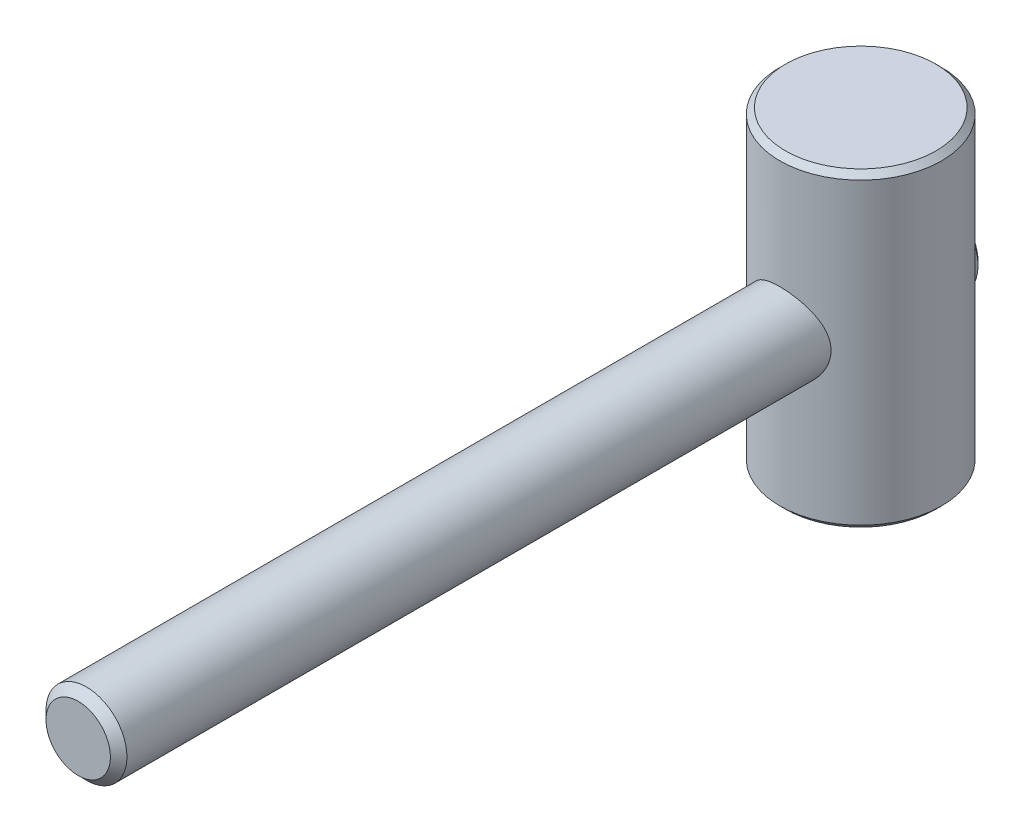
ISO-10303-21;
HEADER;
FILE_DESCRIPTION(('STEP AP214'),'2;1');
FILE_NAME('part.step','',(''),(''),'','','');
FILE_SCHEMA(('AUTOMOTIVE_DESIGN { 1 0 10303 214 1 1 1 1 }'));
ENDSEC;
DATA;
#1=APPLICATION_CONTEXT('core data for automotive mechanical design processes');
#2=APPLICATION_PROTOCOL_DEFINITION('international standard','automotive_design',2000,#1);
#3=PRODUCT_CONTEXT('',#1,'mechanical');
#4=PRODUCT('Part','Part','',(#3));
#5=PRODUCT_RELATED_PRODUCT_CATEGORY('part','',(#4));
#6=PRODUCT_DEFINITION_FORMATION('','',#4);
#7=PRODUCT_DEFINITION_CONTEXT('part definition',#1,'design');
#8=PRODUCT_DEFINITION('design','',#6,#7);
#9=PRODUCT_DEFINITION_SHAPE('','',#8);
#10=(LENGTH_UNIT() NAMED_UNIT(*) SI_UNIT(.MILLI.,.METRE.));
#11=(NAMED_UNIT(*) PLANE_ANGLE_UNIT() SI_UNIT($,.RADIAN.));
#12=(NAMED_UNIT(*) SI_UNIT($,.STERADIAN.) SOLID_ANGLE_UNIT());
#13=UNCERTAINTY_MEASURE_WITH_UNIT(LENGTH_MEASURE(1.E-05),#10,'distance_accuracy_value','');
#14=(GEOMETRIC_REPRESENTATION_CONTEXT(3) GLOBAL_UNCERTAINTY_ASSIGNED_CONTEXT((#13)) GLOBAL_UNIT_ASSIGNED_CONTEXT((#10,
#11,#12)) REPRESENTATION_CONTEXT('',''));
#15=CARTESIAN_POINT('',(0.,0.,0.));
#16=DIRECTION('',(0.,0.,1.));
#17=DIRECTION('',(1.,0.,0.));
#18=AXIS2_PLACEMENT_3D('',#15,#16,#17);
#19=CARTESIAN_POINT('',(0.,0.,-5.));
#20=DIRECTION('',(0.,0.,1.));
#21=DIRECTION('',(1.,0.,0.));
#22=AXIS2_PLACEMENT_3D('',#19,#20,#21);
#23=CYLINDRICAL_SURFACE('',#22,1.5);
#24=CARTESIAN_POINT('',(-0.947331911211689,1.16299709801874,-11.8465));
#25=CARTESIAN_POINT('',(-1.01351143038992,1.10908406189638,-11.8245053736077));
#26=CARTESIAN_POINT('',(-1.07489527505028,1.04969000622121,-11.801479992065));
#27=CARTESIAN_POINT('',(-1.18710041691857,0.920938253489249,-11.7558012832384));
#28=CARTESIAN_POINT('',(-1.2378650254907,0.851530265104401,-11.7331505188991));
#29=CARTESIAN_POINT('',(-1.32722551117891,0.704204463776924,-11.6908987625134));
#30=CARTESIAN_POINT('',(-1.36579908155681,0.626271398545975,-11.6713033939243));
#31=CARTESIAN_POINT('',(-1.42909401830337,0.46394540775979,-11.6379877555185));
#32=CARTESIAN_POINT('',(-1.45385048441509,0.379569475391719,-11.6242526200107));
#33=CARTESIAN_POINT('',(-1.48697739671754,0.213368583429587,-11.6056166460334));
#34=CARTESIAN_POINT('',(-1.49644089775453,0.131829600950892,-11.6001287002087));
#35=CARTESIAN_POINT('',(-1.5018928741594,-0.0318566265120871,-11.5969853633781));
#36=CARTESIAN_POINT('',(-1.49788424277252,-0.114003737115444,-11.5993282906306));
#37=CARTESIAN_POINT('',(-1.47773438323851,-0.267779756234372,-11.6108251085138));
#38=CARTESIAN_POINT('',(-1.4628558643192,-0.339634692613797,-11.6192692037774));
#39=CARTESIAN_POINT('',(-1.42308110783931,-0.479735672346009,-11.6410889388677));
#40=CARTESIAN_POINT('',(-1.39818007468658,-0.547979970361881,-11.6544669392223));
#41=CARTESIAN_POINT('',(-1.33746138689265,-0.683395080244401,-11.6855957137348));
#42=CARTESIAN_POINT('',(-1.30108662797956,-0.750265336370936,-11.7035578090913));
#43=CARTESIAN_POINT('',(-1.21901847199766,-0.877331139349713,-11.7415381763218));
#44=CARTESIAN_POINT('',(-1.17332890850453,-0.93752941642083,-11.7615556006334));
#45=CARTESIAN_POINT('',(-1.09644538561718,-1.02443697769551,-11.7926076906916));
#46=CARTESIAN_POINT('',(-1.06820925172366,-1.05384666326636,-11.8035531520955));
#47=CARTESIAN_POINT('',(-1.00945808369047,-1.11024632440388,-11.825238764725));
#48=CARTESIAN_POINT('',(-0.978947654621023,-1.13724095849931,-11.8359792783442));
#49=CARTESIAN_POINT('',(-0.947331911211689,-1.16299709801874,-11.8465));
#50=B_SPLINE_CURVE_WITH_KNOTS('',3,(#24,#25,#26,#27,#28,#29,#30,#31,#32,#33,#34,#35,#36,#37,#38,
#39,#40,#41,#42,#43,#44,#45,#46,#47,#48,#49),.UNSPECIFIED.,.F.,.F.,(4,2,2,2,2,2,2,2,2,2,2,2,4),
(0.,0.264174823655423,0.52972579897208,0.795759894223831,1.06111506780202,1.30649824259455,
1.55182872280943,1.77244859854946,1.99317416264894,2.22691434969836,2.46055853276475,
2.58708455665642,2.71336100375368),.UNSPECIFIED.);
#51=CARTESIAN_POINT('',(-0.947331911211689,1.16299709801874,-11.8465));
#52=VERTEX_POINT('',#51);
#53=CARTESIAN_POINT('',(-0.947331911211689,-1.16299709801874,-11.8465));
#54=VERTEX_POINT('',#53);
#55=EDGE_CURVE('E271',#52,#54,#50,.T.);
#56=ORIENTED_EDGE('',*,*,#55,.F.);
#57=CARTESIAN_POINT('',(0.,0.,-11.8465));
#58=DIRECTION('',(0.,0.,1.));
#59=DIRECTION('',(1.,0.,0.));
#60=AXIS2_PLACEMENT_3D('',#57,#58,#59);
#61=CIRCLE('',#60,1.5);
#62=EDGE_CURVE('E308',#52,#54,#61,.T.);
#63=ORIENTED_EDGE('',*,*,#62,.T.);
#64=EDGE_LOOP('',(#56,#63));
#65=FACE_BOUND('',#64,.T.);
#66=ADVANCED_FACE('F14',(#65),#23,.T.);
#67=CARTESIAN_POINT('',(0.,0.,-12.));
#68=DIRECTION('',(0.,0.,1.));
#69=DIRECTION('',(1.,0.,0.));
#70=AXIS2_PLACEMENT_3D('',#67,#68,#69);
#71=PLANE('',#70);
#72=DIRECTION('',(0.,-1.,0.));
#73=VECTOR('',#72,1.);
#74=CARTESIAN_POINT('',(0.3,0.,-12.));
#75=LINE('',#74,#73);
#76=CARTESIAN_POINT('',(0.3,1.31265465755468,-12.));
#77=VERTEX_POINT('',#76);
#78=CARTESIAN_POINT('',(0.3,-1.31265465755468,-12.));
#79=VERTEX_POINT('',#78);
#80=EDGE_CURVE('E36',#77,#79,#75,.T.);
#81=ORIENTED_EDGE('',*,*,#80,.F.);
#82=CARTESIAN_POINT('',(0.,0.,-12.));
#83=DIRECTION('',(0.,0.,1.));
#84=DIRECTION('',(1.,0.,0.));
#85=AXIS2_PLACEMENT_3D('',#82,#83,#84);
#86=CIRCLE('',#85,1.3465);
#87=EDGE_CURVE('E305',#79,#77,#86,.T.);
#88=ORIENTED_EDGE('',*,*,#87,.F.);
#89=EDGE_LOOP('',(#81,#88));
#90=FACE_BOUND('',#89,.T.);
#91=ADVANCED_FACE('F231',(#90),#71,.F.);
#92=CARTESIAN_POINT('',(0.,0.,-12.));
#93=DIRECTION('',(0.,0.,1.));
#94=DIRECTION('',(1.,0.,0.));
#95=AXIS2_PLACEMENT_3D('',#92,#93,#94);
#96=CONICAL_SURFACE('',#95,1.3465,0.785398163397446);
#97=CARTESIAN_POINT('',(0.992835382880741,1.14506318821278,-11.83095));
#98=CARTESIAN_POINT('',(0.929590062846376,1.17057691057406,-11.8531359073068));
#99=CARTESIAN_POINT('',(0.864893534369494,1.19430901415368,-11.8734384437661));
#100=CARTESIAN_POINT('',(0.733580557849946,1.23716783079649,-11.9097164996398));
#101=CARTESIAN_POINT('',(0.666989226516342,1.25633751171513,-11.9257325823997));
#102=CARTESIAN_POINT('',(0.531496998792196,1.28959120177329,-11.9533515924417));
#103=CARTESIAN_POINT('',(0.462592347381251,1.30366645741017,-11.9649469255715));
#104=CARTESIAN_POINT('',(0.322550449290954,1.32622709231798,-11.9834605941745));
#105=CARTESIAN_POINT('',(0.251397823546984,1.33465555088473,-11.9903313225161));
#106=CARTESIAN_POINT('',(0.1798,1.33988292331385,-11.994607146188));
#107=B_SPLINE_CURVE_WITH_KNOTS('',3,(#97,#98,#99,#100,#101,#102,#103,#104,#105,#106),
.UNSPECIFIED.,.F.,.F.,(4,2,2,2,4),(0.,0.215180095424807,0.428245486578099,0.641675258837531,
0.857225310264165),.UNSPECIFIED.);
#108=CARTESIAN_POINT('',(0.947331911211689,1.16299709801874,-11.8465));
#109=VERTEX_POINT('',#108);
#110=CARTESIAN_POINT('',(0.674247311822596,1.25340780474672,-11.92325));
#111=VERTEX_POINT('',#110);
#112=EDGE_CURVE('E108',#109,#111,#107,.T.);
#113=ORIENTED_EDGE('',*,*,#112,.F.);
#114=CARTESIAN_POINT('',(0.947331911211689,-1.16299709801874,-11.8465));
#115=VERTEX_POINT('',#114);
#116=EDGE_CURVE('E309',#115,#109,#61,.T.);
#117=ORIENTED_EDGE('',*,*,#116,.F.);
#118=CARTESIAN_POINT('',(0.1798,-1.33988292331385,-11.994607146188));
#119=CARTESIAN_POINT('',(0.236038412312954,-1.335761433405,-11.9912402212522));
#120=CARTESIAN_POINT('',(0.292017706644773,-1.3296804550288,-11.9862800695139));
#121=CARTESIAN_POINT('',(0.40306300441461,-1.31386344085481,-11.9733225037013));
#122=CARTESIAN_POINT('',(0.458129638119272,-1.30413004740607,-11.9653272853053));
#123=CARTESIAN_POINT('',(0.566267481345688,-1.28142693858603,-11.9465768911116));
#124=CARTESIAN_POINT('',(0.619355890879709,-1.26850488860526,-11.9358623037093));
#125=CARTESIAN_POINT('',(0.724099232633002,-1.23969917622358,-11.9117977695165));
#126=CARTESIAN_POINT('',(0.775754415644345,-1.22381603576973,-11.8984482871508));
#127=CARTESIAN_POINT('',(0.854754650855,-1.1971455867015,-11.8758046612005));
#128=CARTESIAN_POINT('',(0.882653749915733,-1.18725045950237,-11.8673620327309));
#129=CARTESIAN_POINT('',(0.938066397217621,-1.16670181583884,-11.8497157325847));
#130=CARTESIAN_POINT('',(0.965577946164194,-1.15604541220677,-11.8405091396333));
#131=CARTESIAN_POINT('',(0.992835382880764,-1.14506318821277,-11.83095));
#132=B_SPLINE_CURVE_WITH_KNOTS('',3,(#118,#119,#120,#121,#122,#123,#124,#125,#126,#127,#128,
#129,#130,#131),.UNSPECIFIED.,.F.,.F.,(4,2,2,2,2,2,4),(0.,0.169384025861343,0.338645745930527,
0.505516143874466,0.672357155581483,0.764685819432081,0.857385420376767),.UNSPECIFIED.);
#133=CARTESIAN_POINT('',(0.674247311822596,-1.25340780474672,-11.92325));
#134=VERTEX_POINT('',#133);
#135=EDGE_CURVE('E114',#134,#115,#132,.T.);
#136=ORIENTED_EDGE('',*,*,#135,.F.);
#137=CARTESIAN_POINT('',(0.,0.,-11.92325));
#138=DIRECTION('',(0.,0.,-1.));
#139=DIRECTION('',(-1.,0.,0.));
#140=AXIS2_PLACEMENT_3D('',#137,#138,#139);
#141=CIRCLE('',#140,1.42325);
#142=CARTESIAN_POINT('',(0.3,-1.39127300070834,-11.92325));
#143=VERTEX_POINT('',#142);
#144=EDGE_CURVE('E194',#134,#143,#141,.T.);
#145=ORIENTED_EDGE('',*,*,#144,.T.);
#146=CARTESIAN_POINT('',(0.3,1.4704082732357,-11.8458));
#147=CARTESIAN_POINT('',(0.3,1.43432199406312,-11.881156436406));
#148=CARTESIAN_POINT('',(0.3,1.39821111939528,-11.9164877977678));
#149=CARTESIAN_POINT('',(0.3,1.32586601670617,-11.9871401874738));
#150=CARTESIAN_POINT('',(0.3,1.28963168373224,-12.0224611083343));
#151=CARTESIAN_POINT('',(0.3,1.21609681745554,-12.0939762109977));
#152=CARTESIAN_POINT('',(0.3,1.17879403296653,-12.1301680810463));
#153=CARTESIAN_POINT('',(0.3,1.10413383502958,-12.2023744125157));
#154=CARTESIAN_POINT('',(0.3,1.06677660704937,-12.2383890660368));
#155=CARTESIAN_POINT('',(0.3,0.959421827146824,-12.3414650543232));
#156=CARTESIAN_POINT('',(0.3,0.88924153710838,-12.4083374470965));
#157=CARTESIAN_POINT('',(0.3,0.782999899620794,-12.5080826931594));
#158=CARTESIAN_POINT('',(0.3,0.7473051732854,-12.5413456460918));
#159=CARTESIAN_POINT('',(0.3,0.67557200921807,-12.6074459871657));
#160=CARTESIAN_POINT('',(0.3,0.639533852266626,-12.6402836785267));
#161=CARTESIAN_POINT('',(0.3,0.567825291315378,-12.7044893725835));
#162=CARTESIAN_POINT('',(0.3,0.532169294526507,-12.7358734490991));
#163=CARTESIAN_POINT('',(0.3,0.459887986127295,-12.7977398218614));
#164=CARTESIAN_POINT('',(0.3,0.423260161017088,-12.8282192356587));
#165=CARTESIAN_POINT('',(0.3,0.367400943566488,-12.8723076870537));
#166=CARTESIAN_POINT('',(0.3,0.348748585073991,-12.8866467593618));
#167=CARTESIAN_POINT('',(0.3,0.310930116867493,-12.9146268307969));
#168=CARTESIAN_POINT('',(0.3,0.291764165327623,-12.9282680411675));
#169=CARTESIAN_POINT('',(0.3,0.252814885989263,-12.9544441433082));
#170=CARTESIAN_POINT('',(0.3,0.233034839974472,-12.9669838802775));
#171=CARTESIAN_POINT('',(0.3,0.192530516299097,-12.990417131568));
#172=CARTESIAN_POINT('',(0.3,0.171808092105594,-13.0013137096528));
#173=CARTESIAN_POINT('',(0.3,0.145940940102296,-13.0129096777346));
#174=CARTESIAN_POINT('',(0.3,0.141366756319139,-13.0148871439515));
#175=CARTESIAN_POINT('',(0.3,0.132159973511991,-13.0187064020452));
#176=CARTESIAN_POINT('',(0.3,0.127527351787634,-13.0205481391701));
#177=CARTESIAN_POINT('',(0.3,0.113544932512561,-13.0258474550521));
#178=CARTESIAN_POINT('',(0.3,0.104108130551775,-13.0290802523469));
#179=CARTESIAN_POINT('',(0.3,0.0851689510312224,-13.0347728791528));
#180=CARTESIAN_POINT('',(0.3,0.0756701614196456,-13.0372444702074));
#181=CARTESIAN_POINT('',(0.3,0.0564948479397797,-13.0413716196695));
#182=CARTESIAN_POINT('',(0.3,0.0468182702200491,-13.0430269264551));
#183=CARTESIAN_POINT('',(0.3,0.0172377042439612,-13.0466422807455));
#184=CARTESIAN_POINT('',(0.3,-0.00287379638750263,-13.047140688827));
#185=CARTESIAN_POINT('',(0.3,-0.0428030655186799,-13.0441231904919));
#186=CARTESIAN_POINT('',(0.3,-0.0626200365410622,-13.0405978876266));
#187=CARTESIAN_POINT('',(0.3,-0.108260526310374,-13.0285808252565));
#188=CARTESIAN_POINT('',(0.3,-0.133719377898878,-13.0187703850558));
#189=CARTESIAN_POINT('',(0.3,-0.17070809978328,-13.0015048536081));
#190=CARTESIAN_POINT('',(0.3,-0.182880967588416,-12.9952966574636));
#191=CARTESIAN_POINT('',(0.3,-0.206871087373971,-12.9822268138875));
#192=CARTESIAN_POINT('',(0.3,-0.218688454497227,-12.9753653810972));
#193=CARTESIAN_POINT('',(0.3,-0.256757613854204,-12.9521887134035));
#194=CARTESIAN_POINT('',(0.3,-0.282394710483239,-12.9348757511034));
#195=CARTESIAN_POINT('',(0.3,-0.332686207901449,-12.8988661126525));
#196=CARTESIAN_POINT('',(0.3,-0.357339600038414,-12.8801680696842));
#197=CARTESIAN_POINT('',(0.3,-0.406041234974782,-12.8418786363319));
#198=CARTESIAN_POINT('',(0.3,-0.43008777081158,-12.8222850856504));
#199=CARTESIAN_POINT('',(0.3,-0.477720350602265,-12.7825441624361));
#200=CARTESIAN_POINT('',(0.3,-0.501306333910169,-12.762396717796));
#201=CARTESIAN_POINT('',(0.3,-0.571740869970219,-12.7012598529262));
#202=CARTESIAN_POINT('',(0.3,-0.618101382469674,-12.6597098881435));
#203=CARTESIAN_POINT('',(0.3,-0.710039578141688,-12.5759094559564));
#204=CARTESIAN_POINT('',(0.3,-0.755618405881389,-12.5336602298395));
#205=CARTESIAN_POINT('',(0.3,-0.857897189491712,-12.4378825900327));
#206=CARTESIAN_POINT('',(0.3,-0.914473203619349,-12.3842219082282));
#207=CARTESIAN_POINT('',(0.3,-1.02726219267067,-12.2764551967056));
#208=CARTESIAN_POINT('',(0.3,-1.08347493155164,-12.2223489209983));
#209=CARTESIAN_POINT('',(0.3,-1.19491746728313,-12.1145797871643));
#210=CARTESIAN_POINT('',(0.3,-1.25015053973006,-12.0609203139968));
#211=CARTESIAN_POINT('',(0.3,-1.36040840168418,-11.9534572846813));
#212=CARTESIAN_POINT('',(0.3,-1.41543330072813,-11.8996538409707));
#213=CARTESIAN_POINT('',(0.3,-1.4704082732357,-11.8458));
#214=B_SPLINE_CURVE_WITH_KNOTS('',3,(#146,#147,#148,#149,#150,#151,#152,#153,#154,#155,#156,
#157,#158,#159,#160,#161,#162,#163,#164,#165,#166,#167,#168,#169,#170,#171,#172,#173,#174,#175,
#176,#177,#178,#179,#180,#181,#182,#183,#184,#185,#186,#187,#188,#189,#190,#191,#192,#193,#194,
#195,#196,#197,#198,#199,#200,#201,#202,#203,#204,#205,#206,#207,#208,#209,#210,#211,#212,#213),
.UNSPECIFIED.,.F.,.F.,(4,2,2,2,2,2,2,2,2,2,2,2,2,2,2,2,2,2,2,2,2,2,2,2,2,2,2,2,2,2,2,2,2,4),(0.,
0.151560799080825,0.303364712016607,0.459287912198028,0.614959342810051,0.905769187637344,
1.05213984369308,1.1983996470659,1.34089509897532,1.48380422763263,1.55437528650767,
1.62492485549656,1.69514667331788,1.76523589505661,1.78018397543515,1.79513805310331,
1.82503814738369,1.85444992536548,1.88387076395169,1.94377833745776,2.00382609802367,
2.08518752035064,2.12617578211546,2.16715062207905,2.25986253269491,2.35266718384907,
2.44570893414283,2.53876285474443,2.72550711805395,2.91194943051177,3.14587396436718,
3.37993768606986,3.6109572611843,3.84183089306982),.UNSPECIFIED.);
#215=EDGE_CURVE('E227',#79,#143,#214,.T.);
#216=ORIENTED_EDGE('',*,*,#215,.F.);
#217=ORIENTED_EDGE('',*,*,#87,.T.);
#218=CARTESIAN_POINT('',(0.3,1.39127300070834,-11.92325));
#219=VERTEX_POINT('',#218);
#220=EDGE_CURVE('E32',#219,#77,#214,.T.);
#221=ORIENTED_EDGE('',*,*,#220,.F.);
#222=CARTESIAN_POINT('',(0.,0.,-11.92325));
#223=DIRECTION('',(0.,0.,-1.));
#224=DIRECTION('',(-1.,0.,0.));
#225=AXIS2_PLACEMENT_3D('',#222,#223,#224);
#226=CIRCLE('',#225,1.42325);
#227=EDGE_CURVE('E104',#219,#111,#226,.T.);
#228=ORIENTED_EDGE('',*,*,#227,.T.);
#229=EDGE_LOOP('',(#113,#117,#136,#145,#216,#217,#221,#228));
#230=FACE_BOUND('',#229,.T.);
#231=ADVANCED_FACE('F106',(#230),#96,.T.);
#232=CARTESIAN_POINT('',(-0.3,0.,-42.3));
#233=DIRECTION('',(1.,0.,0.));
#234=DIRECTION('',(0.,-1.,0.));
#235=AXIS2_PLACEMENT_3D('',#232,#233,#234);
#236=CYLINDRICAL_SURFACE('',#235,31.5);
#237=CARTESIAN_POINT('',(-0.3,-1.33111241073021,-10.8281373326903));
#238=CARTESIAN_POINT('',(-0.262266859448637,-1.33962103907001,-10.8284977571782));
#239=CARTESIAN_POINT('',(-0.224170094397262,-1.34651682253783,-10.828792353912));
#240=CARTESIAN_POINT('',(-0.14752354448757,-1.35705208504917,-10.8292445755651));
#241=CARTESIAN_POINT('',(-0.108973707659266,-1.36069118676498,-10.8294021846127));
#242=CARTESIAN_POINT('',(-0.0324105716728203,-1.36464401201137,-10.8295734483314));
#243=CARTESIAN_POINT('',(0.00559964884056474,-1.3650173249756,-10.8295896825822));
#244=CARTESIAN_POINT('',(0.0815076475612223,-1.36259212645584,-10.8294844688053));
#245=CARTESIAN_POINT('',(0.119405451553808,-1.35979440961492,-10.8293630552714));
#246=CARTESIAN_POINT('',(0.205128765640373,-1.34986012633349,-10.8289356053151));
#247=CARTESIAN_POINT('',(0.252842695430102,-1.34174825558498,-10.8285882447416));
#248=CARTESIAN_POINT('',(0.3,-1.33111241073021,-10.8281373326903));
#249=B_SPLINE_CURVE_WITH_KNOTS('',3,(#237,#238,#239,#240,#241,#242,#243,#244,#245,#246,#247,
#248),.UNSPECIFIED.,.F.,.F.,(4,2,2,2,2,4),(0.,0.116010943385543,0.232035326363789,
0.345938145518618,0.459812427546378,0.604746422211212),.UNSPECIFIED.);
#250=CARTESIAN_POINT('',(-0.3,-1.33111241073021,-10.8281373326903));
#251=VERTEX_POINT('',#250);
#252=CARTESIAN_POINT('',(0.3,-1.33111241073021,-10.8281373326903));
#253=VERTEX_POINT('',#252);
#254=EDGE_CURVE('E199',#251,#253,#249,.T.);
#255=ORIENTED_EDGE('',*,*,#254,.F.);
#256=CARTESIAN_POINT('',(-0.3,0.,-42.3));
#257=DIRECTION('',(-1.,0.,0.));
#258=DIRECTION('',(0.,1.,0.));
#259=AXIS2_PLACEMENT_3D('',#256,#257,#258);
#260=CIRCLE('',#259,31.5);
#261=CARTESIAN_POINT('',(-0.3,1.33111241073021,-10.8281373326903));
#262=VERTEX_POINT('',#261);
#263=EDGE_CURVE('E19',#251,#262,#260,.T.);
#264=ORIENTED_EDGE('',*,*,#263,.T.);
#265=CARTESIAN_POINT('',(0.3,1.33111241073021,-10.8281373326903));
#266=CARTESIAN_POINT('',(0.262266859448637,1.33962103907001,-10.8284977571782));
#267=CARTESIAN_POINT('',(0.224170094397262,1.34651682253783,-10.828792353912));
#268=CARTESIAN_POINT('',(0.14752354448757,1.35705208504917,-10.8292445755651));
#269=CARTESIAN_POINT('',(0.108973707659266,1.36069118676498,-10.8294021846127));
#270=CARTESIAN_POINT('',(0.0324105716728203,1.36464401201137,-10.8295734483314));
#271=CARTESIAN_POINT('',(-0.00559964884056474,1.3650173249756,-10.8295896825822));
#272=CARTESIAN_POINT('',(-0.0815076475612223,1.36259212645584,-10.8294844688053));
#273=CARTESIAN_POINT('',(-0.119405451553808,1.35979440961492,-10.8293630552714));
#274=CARTESIAN_POINT('',(-0.205128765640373,1.34986012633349,-10.8289356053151));
#275=CARTESIAN_POINT('',(-0.252842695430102,1.34174825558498,-10.8285882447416));
#276=CARTESIAN_POINT('',(-0.3,1.33111241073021,-10.8281373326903));
#277=B_SPLINE_CURVE_WITH_KNOTS('',3,(#265,#266,#267,#268,#269,#270,#271,#272,#273,#274,#275,
#276),.UNSPECIFIED.,.F.,.F.,(4,2,2,2,2,4),(0.,0.116010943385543,0.232035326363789,
0.345938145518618,0.459812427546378,0.604746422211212),.UNSPECIFIED.);
#278=CARTESIAN_POINT('',(0.3,1.33111241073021,-10.8281373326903));
#279=VERTEX_POINT('',#278);
#280=EDGE_CURVE('E143',#279,#262,#277,.T.);
#281=ORIENTED_EDGE('',*,*,#280,.F.);
#282=CARTESIAN_POINT('',(0.3,0.,-42.3));
#283=DIRECTION('',(-1.,0.,0.));
#284=DIRECTION('',(0.,1.,0.));
#285=AXIS2_PLACEMENT_3D('',#282,#283,#284);
#286=CIRCLE('',#285,31.5);
#287=EDGE_CURVE('E130',#253,#279,#286,.T.);
#288=ORIENTED_EDGE('',*,*,#287,.F.);
#289=EDGE_LOOP('',(#255,#264,#281,#288));
#290=FACE_BOUND('',#289,.T.);
#291=ADVANCED_FACE('F206',(#290),#236,.F.);
#292=CARTESIAN_POINT('',(0.3,0.,-42.3));
#293=DIRECTION('',(-1.,0.,0.));
#294=DIRECTION('',(0.,1.,0.));
#295=AXIS2_PLACEMENT_3D('',#292,#293,#294);
#296=PLANE('',#295);
#297=CARTESIAN_POINT('',(0.3,-0.671318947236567,-11.2353020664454));
#298=CARTESIAN_POINT('',(0.3,-0.697833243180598,-11.2595157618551));
#299=CARTESIAN_POINT('',(0.3,-0.724235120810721,-11.283851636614));
#300=CARTESIAN_POINT('',(0.3,-0.776860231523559,-11.3327148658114));
#301=CARTESIAN_POINT('',(0.3,-0.803083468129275,-11.3572422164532));
#302=CARTESIAN_POINT('',(0.3,-0.881553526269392,-11.4310312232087));
#303=CARTESIAN_POINT('',(0.3,-0.933603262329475,-11.4805021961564));
#304=CARTESIAN_POINT('',(0.3,-1.03737516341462,-11.5797783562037));
#305=CARTESIAN_POINT('',(0.3,-1.08909735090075,-11.6295835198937));
#306=CARTESIAN_POINT('',(0.3,-1.19232568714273,-11.7294186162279));
#307=CARTESIAN_POINT('',(0.3,-1.24383183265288,-11.7794485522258));
#308=CARTESIAN_POINT('',(0.3,-1.41719880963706,-11.9483370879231));
#309=CARTESIAN_POINT('',(0.3,-1.53872304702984,-12.0675409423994));
#310=CARTESIAN_POINT('',(0.3,-1.72072148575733,-12.2466471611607));
#311=CARTESIAN_POINT('',(0.3,-1.78134186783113,-12.3064015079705));
#312=CARTESIAN_POINT('',(0.3,-1.9025053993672,-12.4259878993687));
#313=CARTESIAN_POINT('',(0.3,-1.96304854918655,-12.4858199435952));
#314=CARTESIAN_POINT('',(0.3,-2.02356348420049,-12.545680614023));
#315=B_SPLINE_CURVE_WITH_KNOTS('',3,(#297,#298,#299,#300,#301,#302,#303,#304,#305,#306,#307,
#308,#309,#310,#311,#312,#313,#314),.UNSPECIFIED.,.F.,.F.,(4,2,2,2,2,2,2,2,4),(0.,
0.107719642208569,0.215437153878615,0.430861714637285,0.646271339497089,0.861684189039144,
1.37236666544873,1.62772666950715,1.88308548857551),.UNSPECIFIED.);
#316=CARTESIAN_POINT('',(0.3,-1.33111241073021,-11.8645));
#317=VERTEX_POINT('',#316);
#318=EDGE_CURVE('E178',#317,#143,#315,.T.);
#319=ORIENTED_EDGE('',*,*,#318,.F.);
#320=DIRECTION('',(0.,0.,1.));
#321=VECTOR('',#320,1.);
#322=CARTESIAN_POINT('',(0.3,-1.33111241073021,-6.));
#323=LINE('',#322,#321);
#324=EDGE_CURVE('E292',#253,#317,#323,.F.);
#325=ORIENTED_EDGE('',*,*,#324,.F.);
#326=ORIENTED_EDGE('',*,*,#287,.T.);
#327=DIRECTION('',(0.,0.,1.));
#328=VECTOR('',#327,1.);
#329=CARTESIAN_POINT('',(0.3,1.33111241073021,-6.));
#330=LINE('',#329,#328);
#331=CARTESIAN_POINT('',(0.3,1.33111241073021,-11.8645));
#332=VERTEX_POINT('',#331);
#333=EDGE_CURVE('E299',#332,#279,#330,.T.);
#334=ORIENTED_EDGE('',*,*,#333,.F.);
#335=CARTESIAN_POINT('',(0.3,2.02134819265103,-12.5434892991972));
#336=CARTESIAN_POINT('',(0.3,1.96583089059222,-12.4885737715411));
#337=CARTESIAN_POINT('',(0.3,1.91028984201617,-12.4336823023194));
#338=CARTESIAN_POINT('',(0.3,1.79914422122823,-12.3239633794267));
#339=CARTESIAN_POINT('',(0.3,1.74353964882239,-12.2691359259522));
#340=CARTESIAN_POINT('',(0.3,1.57661382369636,-12.1047805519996));
#341=CARTESIAN_POINT('',(0.3,1.46517376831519,-11.9953729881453));
#342=CARTESIAN_POINT('',(0.3,1.29755058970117,-11.8317264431));
#343=CARTESIAN_POINT('',(0.3,1.24159669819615,-11.7772528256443));
#344=CARTESIAN_POINT('',(0.3,1.12946087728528,-11.668542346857));
#345=CARTESIAN_POINT('',(0.3,1.07327895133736,-11.614305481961));
#346=CARTESIAN_POINT('',(0.3,0.960561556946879,-11.5061914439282));
#347=CARTESIAN_POINT('',(0.3,0.904026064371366,-11.4523142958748));
#348=CARTESIAN_POINT('',(0.3,0.81878330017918,-11.3719612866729));
#349=CARTESIAN_POINT('',(0.3,0.790295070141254,-11.3452534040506));
#350=CARTESIAN_POINT('',(0.3,0.733115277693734,-11.2920550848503));
#351=CARTESIAN_POINT('',(0.3,0.704423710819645,-11.2655646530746));
#352=CARTESIAN_POINT('',(0.3,0.675602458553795,-11.2392149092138));
#353=B_SPLINE_CURVE_WITH_KNOTS('',3,(#335,#336,#337,#338,#339,#340,#341,#342,#343,#344,#345,
#346,#347,#348,#349,#350,#351,#352),.UNSPECIFIED.,.F.,.F.,(4,2,2,2,2,2,2,2,4),(0.,
0.234266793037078,0.468534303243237,0.937041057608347,1.1713137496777,1.40558290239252,
1.63986822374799,1.75701676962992,1.87416789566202),.UNSPECIFIED.);
#354=EDGE_CURVE('E170',#219,#332,#353,.T.);
#355=ORIENTED_EDGE('',*,*,#354,.F.);
#356=ORIENTED_EDGE('',*,*,#220,.T.);
#357=ORIENTED_EDGE('',*,*,#80,.T.);
#358=ORIENTED_EDGE('',*,*,#215,.T.);
#359=EDGE_LOOP('',(#319,#325,#326,#334,#355,#356,#357,#358));
#360=FACE_BOUND('',#359,.T.);
#361=ADVANCED_FACE('F210',(#360),#296,.T.);
#362=CARTESIAN_POINT('',(-0.3,1.31265465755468,-12.));
#363=VERTEX_POINT('',#362);
#364=CARTESIAN_POINT('',(-0.3,-1.31265465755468,-12.));
#365=VERTEX_POINT('',#364);
#366=EDGE_CURVE('E301',#363,#365,#86,.T.);
#367=ORIENTED_EDGE('',*,*,#366,.F.);
#368=DIRECTION('',(0.,-1.,0.));
#369=VECTOR('',#368,1.);
#370=CARTESIAN_POINT('',(-0.3,0.,-12.));
#371=LINE('',#370,#369);
#372=EDGE_CURVE('E311',#363,#365,#371,.T.);
#373=ORIENTED_EDGE('',*,*,#372,.T.);
#374=EDGE_LOOP('',(#367,#373));
#375=FACE_BOUND('',#374,.T.);
#376=ADVANCED_FACE('F218',(#375),#71,.F.);
#377=CARTESIAN_POINT('',(-0.1798,1.33988292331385,-11.994607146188));
#378=CARTESIAN_POINT('',(-0.236038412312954,1.335761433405,-11.9912402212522));
#379=CARTESIAN_POINT('',(-0.292017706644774,1.3296804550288,-11.9862800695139));
#380=CARTESIAN_POINT('',(-0.403063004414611,1.31386344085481,-11.9733225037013));
#381=CARTESIAN_POINT('',(-0.458129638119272,1.30413004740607,-11.9653272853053));
#382=CARTESIAN_POINT('',(-0.566267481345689,1.28142693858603,-11.9465768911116));
#383=CARTESIAN_POINT('',(-0.61935589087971,1.26850488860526,-11.9358623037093));
#384=CARTESIAN_POINT('',(-0.724099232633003,1.23969917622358,-11.9117977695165));
#385=CARTESIAN_POINT('',(-0.775754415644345,1.22381603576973,-11.8984482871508));
#386=CARTESIAN_POINT('',(-0.854754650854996,1.1971455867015,-11.8758046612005));
#387=CARTESIAN_POINT('',(-0.882653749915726,1.18725045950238,-11.8673620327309));
#388=CARTESIAN_POINT('',(-0.938066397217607,1.16670181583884,-11.8497157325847));
#389=CARTESIAN_POINT('',(-0.965577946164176,1.15604541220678,-11.8405091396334));
#390=CARTESIAN_POINT('',(-0.992835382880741,1.14506318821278,-11.83095));
#391=B_SPLINE_CURVE_WITH_KNOTS('',3,(#377,#378,#379,#380,#381,#382,#383,#384,#385,#386,#387,
#388,#389,#390),.UNSPECIFIED.,.F.,.F.,(4,2,2,2,2,2,4),(0.,0.169384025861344,0.338645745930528,
0.505516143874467,0.672357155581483,0.764685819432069,0.857385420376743),.UNSPECIFIED.);
#392=CARTESIAN_POINT('',(-0.674247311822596,1.25340780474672,-11.92325));
#393=VERTEX_POINT('',#392);
#394=EDGE_CURVE('E250',#393,#52,#391,.T.);
#395=ORIENTED_EDGE('',*,*,#394,.F.);
#396=CARTESIAN_POINT('',(0.,0.,-11.92325));
#397=DIRECTION('',(0.,0.,-1.));
#398=DIRECTION('',(-1.,0.,0.));
#399=AXIS2_PLACEMENT_3D('',#396,#397,#398);
#400=CIRCLE('',#399,1.42325);
#401=CARTESIAN_POINT('',(-0.3,1.39127300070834,-11.92325));
#402=VERTEX_POINT('',#401);
#403=EDGE_CURVE('E128',#393,#402,#400,.T.);
#404=ORIENTED_EDGE('',*,*,#403,.T.);
#405=CARTESIAN_POINT('',(-0.3,1.4704082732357,-11.8458));
#406=CARTESIAN_POINT('',(-0.3,1.43432199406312,-11.881156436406));
#407=CARTESIAN_POINT('',(-0.3,1.39821111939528,-11.9164877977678));
#408=CARTESIAN_POINT('',(-0.3,1.32586601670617,-11.9871401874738));
#409=CARTESIAN_POINT('',(-0.3,1.28963168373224,-12.0224611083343));
#410=CARTESIAN_POINT('',(-0.3,1.21609681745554,-12.0939762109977));
#411=CARTESIAN_POINT('',(-0.3,1.17879403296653,-12.1301680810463));
#412=CARTESIAN_POINT('',(-0.3,1.10413383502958,-12.2023744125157));
#413=CARTESIAN_POINT('',(-0.3,1.06677660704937,-12.2383890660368));
#414=CARTESIAN_POINT('',(-0.3,0.959421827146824,-12.3414650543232));
#415=CARTESIAN_POINT('',(-0.3,0.88924153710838,-12.4083374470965));
#416=CARTESIAN_POINT('',(-0.3,0.782999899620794,-12.5080826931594));
#417=CARTESIAN_POINT('',(-0.3,0.7473051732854,-12.5413456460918));
#418=CARTESIAN_POINT('',(-0.3,0.67557200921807,-12.6074459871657));
#419=CARTESIAN_POINT('',(-0.3,0.639533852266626,-12.6402836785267));
#420=CARTESIAN_POINT('',(-0.3,0.567825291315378,-12.7044893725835));
#421=CARTESIAN_POINT('',(-0.3,0.532169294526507,-12.7358734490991));
#422=CARTESIAN_POINT('',(-0.3,0.459887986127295,-12.7977398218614));
#423=CARTESIAN_POINT('',(-0.3,0.423260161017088,-12.8282192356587));
#424=CARTESIAN_POINT('',(-0.3,0.367400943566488,-12.8723076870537));
#425=CARTESIAN_POINT('',(-0.3,0.348748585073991,-12.8866467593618));
#426=CARTESIAN_POINT('',(-0.3,0.310930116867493,-12.9146268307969));
#427=CARTESIAN_POINT('',(-0.3,0.291764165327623,-12.9282680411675));
#428=CARTESIAN_POINT('',(-0.3,0.252814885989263,-12.9544441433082));
#429=CARTESIAN_POINT('',(-0.3,0.233034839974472,-12.9669838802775));
#430=CARTESIAN_POINT('',(-0.3,0.192530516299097,-12.990417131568));
#431=CARTESIAN_POINT('',(-0.3,0.171808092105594,-13.0013137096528));
#432=CARTESIAN_POINT('',(-0.3,0.145940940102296,-13.0129096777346));
#433=CARTESIAN_POINT('',(-0.3,0.141366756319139,-13.0148871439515));
#434=CARTESIAN_POINT('',(-0.3,0.132159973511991,-13.0187064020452));
#435=CARTESIAN_POINT('',(-0.3,0.127527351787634,-13.0205481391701));
#436=CARTESIAN_POINT('',(-0.3,0.113544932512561,-13.0258474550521));
#437=CARTESIAN_POINT('',(-0.3,0.104108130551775,-13.0290802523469));
#438=CARTESIAN_POINT('',(-0.3,0.0851689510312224,-13.0347728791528));
#439=CARTESIAN_POINT('',(-0.3,0.0756701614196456,-13.0372444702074));
#440=CARTESIAN_POINT('',(-0.3,0.0564948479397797,-13.0413716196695));
#441=CARTESIAN_POINT('',(-0.3,0.0468182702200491,-13.0430269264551));
#442=CARTESIAN_POINT('',(-0.3,0.0172377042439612,-13.0466422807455));
#443=CARTESIAN_POINT('',(-0.3,-0.00287379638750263,-13.047140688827));
#444=CARTESIAN_POINT('',(-0.3,-0.0428030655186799,-13.0441231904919));
#445=CARTESIAN_POINT('',(-0.3,-0.0626200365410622,-13.0405978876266));
#446=CARTESIAN_POINT('',(-0.3,-0.108260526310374,-13.0285808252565));
#447=CARTESIAN_POINT('',(-0.3,-0.133719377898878,-13.0187703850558));
#448=CARTESIAN_POINT('',(-0.3,-0.17070809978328,-13.0015048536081));
#449=CARTESIAN_POINT('',(-0.3,-0.182880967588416,-12.9952966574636));
#450=CARTESIAN_POINT('',(-0.3,-0.206871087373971,-12.9822268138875));
#451=CARTESIAN_POINT('',(-0.3,-0.218688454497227,-12.9753653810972));
#452=CARTESIAN_POINT('',(-0.3,-0.256757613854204,-12.9521887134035));
#453=CARTESIAN_POINT('',(-0.3,-0.282394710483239,-12.9348757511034));
#454=CARTESIAN_POINT('',(-0.3,-0.332686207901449,-12.8988661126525));
#455=CARTESIAN_POINT('',(-0.3,-0.357339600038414,-12.8801680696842));
#456=CARTESIAN_POINT('',(-0.3,-0.406041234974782,-12.8418786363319));
#457=CARTESIAN_POINT('',(-0.3,-0.43008777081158,-12.8222850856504));
#458=CARTESIAN_POINT('',(-0.3,-0.477720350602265,-12.7825441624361));
#459=CARTESIAN_POINT('',(-0.3,-0.501306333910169,-12.762396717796));
#460=CARTESIAN_POINT('',(-0.3,-0.571740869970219,-12.7012598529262));
#461=CARTESIAN_POINT('',(-0.3,-0.618101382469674,-12.6597098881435));
#462=CARTESIAN_POINT('',(-0.3,-0.710039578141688,-12.5759094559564));
#463=CARTESIAN_POINT('',(-0.3,-0.755618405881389,-12.5336602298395));
#464=CARTESIAN_POINT('',(-0.3,-0.857897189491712,-12.4378825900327));
#465=CARTESIAN_POINT('',(-0.3,-0.914473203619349,-12.3842219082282));
#466=CARTESIAN_POINT('',(-0.3,-1.02726219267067,-12.2764551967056));
#467=CARTESIAN_POINT('',(-0.3,-1.08347493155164,-12.2223489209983));
#468=CARTESIAN_POINT('',(-0.3,-1.19491746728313,-12.1145797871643));
#469=CARTESIAN_POINT('',(-0.3,-1.25015053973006,-12.0609203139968));
#470=CARTESIAN_POINT('',(-0.3,-1.36040840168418,-11.9534572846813));
#471=CARTESIAN_POINT('',(-0.3,-1.41543330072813,-11.8996538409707));
#472=CARTESIAN_POINT('',(-0.3,-1.4704082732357,-11.8458));
#473=B_SPLINE_CURVE_WITH_KNOTS('',3,(#405,#406,#407,#408,#409,#410,#411,#412,#413,#414,#415,
#416,#417,#418,#419,#420,#421,#422,#423,#424,#425,#426,#427,#428,#429,#430,#431,#432,#433,#434,
#435,#436,#437,#438,#439,#440,#441,#442,#443,#444,#445,#446,#447,#448,#449,#450,#451,#452,#453,
#454,#455,#456,#457,#458,#459,#460,#461,#462,#463,#464,#465,#466,#467,#468,#469,#470,#471,#472),
.UNSPECIFIED.,.F.,.F.,(4,2,2,2,2,2,2,2,2,2,2,2,2,2,2,2,2,2,2,2,2,2,2,2,2,2,2,2,2,2,2,2,2,4),(0.,
0.151560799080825,0.303364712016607,0.459287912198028,0.614959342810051,0.905769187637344,
1.05213984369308,1.1983996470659,1.34089509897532,1.48380422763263,1.55437528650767,
1.62492485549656,1.69514667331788,1.76523589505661,1.78018397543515,1.79513805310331,
1.82503814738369,1.85444992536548,1.88387076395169,1.94377833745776,2.00382609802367,
2.08518752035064,2.12617578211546,2.16715062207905,2.25986253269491,2.35266718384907,
2.44570893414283,2.53876285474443,2.72550711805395,2.91194943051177,3.14587396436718,
3.37993768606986,3.6109572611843,3.84183089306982),.UNSPECIFIED.);
#474=EDGE_CURVE('E237',#402,#363,#473,.T.);
#475=ORIENTED_EDGE('',*,*,#474,.T.);
#476=ORIENTED_EDGE('',*,*,#366,.T.);
#477=CARTESIAN_POINT('',(-0.3,-1.39127300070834,-11.92325));
#478=VERTEX_POINT('',#477);
#479=EDGE_CURVE('E310',#365,#478,#473,.T.);
#480=ORIENTED_EDGE('',*,*,#479,.T.);
#481=CARTESIAN_POINT('',(0.,0.,-11.92325));
#482=DIRECTION('',(0.,0.,-1.));
#483=DIRECTION('',(-1.,0.,0.));
#484=AXIS2_PLACEMENT_3D('',#481,#482,#483);
#485=CIRCLE('',#484,1.42325);
#486=CARTESIAN_POINT('',(-0.674247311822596,-1.25340780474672,-11.92325));
#487=VERTEX_POINT('',#486);
#488=EDGE_CURVE('E193',#478,#487,#485,.T.);
#489=ORIENTED_EDGE('',*,*,#488,.T.);
#490=CARTESIAN_POINT('',(-0.992835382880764,-1.14506318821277,-11.83095));
#491=CARTESIAN_POINT('',(-0.929590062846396,-1.17057691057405,-11.8531359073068));
#492=CARTESIAN_POINT('',(-0.864893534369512,-1.19430901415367,-11.8734384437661));
#493=CARTESIAN_POINT('',(-0.733580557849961,-1.23716783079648,-11.9097164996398));
#494=CARTESIAN_POINT('',(-0.666989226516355,-1.25633751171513,-11.9257325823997));
#495=CARTESIAN_POINT('',(-0.531496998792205,-1.28959120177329,-11.9533515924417));
#496=CARTESIAN_POINT('',(-0.462592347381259,-1.30366645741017,-11.9649469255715));
#497=CARTESIAN_POINT('',(-0.322550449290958,-1.32622709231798,-11.9834605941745));
#498=CARTESIAN_POINT('',(-0.251397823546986,-1.33465555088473,-11.9903313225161));
#499=CARTESIAN_POINT('',(-0.1798,-1.33988292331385,-11.994607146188));
#500=B_SPLINE_CURVE_WITH_KNOTS('',3,(#490,#491,#492,#493,#494,#495,#496,#497,#498,#499),
.UNSPECIFIED.,.F.,.F.,(4,2,2,2,4),(0.,0.215180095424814,0.42824548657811,0.641675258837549,
0.857225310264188),.UNSPECIFIED.);
#501=EDGE_CURVE('E244',#54,#487,#500,.T.);
#502=ORIENTED_EDGE('',*,*,#501,.F.);
#503=ORIENTED_EDGE('',*,*,#62,.F.);
#504=EDGE_LOOP('',(#395,#404,#475,#476,#480,#489,#502,#503));
#505=FACE_BOUND('',#504,.T.);
#506=ADVANCED_FACE('F232',(#505),#96,.T.);
#507=CARTESIAN_POINT('',(-0.3,0.,-42.3));
#508=DIRECTION('',(-1.,0.,0.));
#509=DIRECTION('',(0.,1.,0.));
#510=AXIS2_PLACEMENT_3D('',#507,#508,#509);
#511=PLANE('',#510);
#512=DIRECTION('',(0.,0.,1.));
#513=VECTOR('',#512,1.);
#514=CARTESIAN_POINT('',(-0.3,-1.33111241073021,-6.));
#515=LINE('',#514,#513);
#516=CARTESIAN_POINT('',(-0.3,-1.33111241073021,-11.8645));
#517=VERTEX_POINT('',#516);
#518=EDGE_CURVE('E192',#251,#517,#515,.F.);
#519=ORIENTED_EDGE('',*,*,#518,.T.);
#520=CARTESIAN_POINT('',(-0.3,-0.671318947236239,-11.2353020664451));
#521=CARTESIAN_POINT('',(-0.3,-0.697833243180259,-11.2595157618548));
#522=CARTESIAN_POINT('',(-0.3,-0.724235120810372,-11.2838516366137));
#523=CARTESIAN_POINT('',(-0.3,-0.77686023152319,-11.3327148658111));
#524=CARTESIAN_POINT('',(-0.3,-0.803083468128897,-11.3572422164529));
#525=CARTESIAN_POINT('',(-0.3,-0.881553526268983,-11.4310312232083));
#526=CARTESIAN_POINT('',(-0.3,-0.933603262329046,-11.480502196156));
#527=CARTESIAN_POINT('',(-0.3,-1.03737516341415,-11.5797783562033));
#528=CARTESIAN_POINT('',(-0.3,-1.08909735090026,-11.6295835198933));
#529=CARTESIAN_POINT('',(-0.3,-1.1923256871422,-11.7294186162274));
#530=CARTESIAN_POINT('',(-0.3,-1.24383183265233,-11.7794485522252));
#531=CARTESIAN_POINT('',(-0.3,-1.41719880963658,-11.9483370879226));
#532=CARTESIAN_POINT('',(-0.3,-1.53872304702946,-12.067540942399));
#533=CARTESIAN_POINT('',(-0.3,-1.72072148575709,-12.2466471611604));
#534=CARTESIAN_POINT('',(-0.3,-1.78134186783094,-12.3064015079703));
#535=CARTESIAN_POINT('',(-0.3,-1.9025053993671,-12.4259878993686));
#536=CARTESIAN_POINT('',(-0.3,-1.9630485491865,-12.4858199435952));
#537=CARTESIAN_POINT('',(-0.3,-2.02356348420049,-12.545680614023));
#538=B_SPLINE_CURVE_WITH_KNOTS('',3,(#520,#521,#522,#523,#524,#525,#526,#527,#528,#529,#530,
#531,#532,#533,#534,#535,#536,#537),.UNSPECIFIED.,.F.,.F.,(4,2,2,2,2,2,2,2,4),(0.,
0.107719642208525,0.215437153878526,0.430861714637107,0.646271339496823,0.86168418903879,
1.37236666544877,1.6277266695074,1.88308548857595),.UNSPECIFIED.);
#539=EDGE_CURVE('E185',#517,#478,#538,.T.);
#540=ORIENTED_EDGE('',*,*,#539,.T.);
#541=ORIENTED_EDGE('',*,*,#479,.F.);
#542=ORIENTED_EDGE('',*,*,#372,.F.);
#543=ORIENTED_EDGE('',*,*,#474,.F.);
#544=CARTESIAN_POINT('',(-0.3,2.02134819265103,-12.5434892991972));
#545=CARTESIAN_POINT('',(-0.3,1.96583089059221,-12.4885737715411));
#546=CARTESIAN_POINT('',(-0.3,1.91028984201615,-12.4336823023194));
#547=CARTESIAN_POINT('',(-0.3,1.79914422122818,-12.3239633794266));
#548=CARTESIAN_POINT('',(-0.3,1.74353964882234,-12.2691359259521));
#549=CARTESIAN_POINT('',(-0.3,1.57661382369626,-12.1047805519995));
#550=CARTESIAN_POINT('',(-0.3,1.46517376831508,-11.9953729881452));
#551=CARTESIAN_POINT('',(-0.3,1.29755058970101,-11.8317264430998));
#552=CARTESIAN_POINT('',(-0.3,1.24159669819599,-11.7772528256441));
#553=CARTESIAN_POINT('',(-0.3,1.12946087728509,-11.6685423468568));
#554=CARTESIAN_POINT('',(-0.3,1.07327895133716,-11.6143054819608));
#555=CARTESIAN_POINT('',(-0.3,0.960561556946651,-11.506191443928));
#556=CARTESIAN_POINT('',(-0.3,0.904026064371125,-11.4523142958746));
#557=CARTESIAN_POINT('',(-0.3,0.818783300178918,-11.3719612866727));
#558=CARTESIAN_POINT('',(-0.3,0.790295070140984,-11.3452534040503));
#559=CARTESIAN_POINT('',(-0.3,0.733115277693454,-11.2920550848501));
#560=CARTESIAN_POINT('',(-0.3,0.70442371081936,-11.2655646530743));
#561=CARTESIAN_POINT('',(-0.3,0.675602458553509,-11.2392149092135));
#562=B_SPLINE_CURVE_WITH_KNOTS('',3,(#544,#545,#546,#547,#548,#549,#550,#551,#552,#553,#554,
#555,#556,#557,#558,#559,#560,#561),.UNSPECIFIED.,.F.,.F.,(4,2,2,2,2,2,2,2,4),(0.,
0.234266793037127,0.468534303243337,0.937041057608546,1.17131374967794,1.40558290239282,
1.63986822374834,1.7570167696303,1.87416789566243),.UNSPECIFIED.);
#563=CARTESIAN_POINT('',(-0.3,1.33111241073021,-11.8645));
#564=VERTEX_POINT('',#563);
#565=EDGE_CURVE('E198',#402,#564,#562,.T.);
#566=ORIENTED_EDGE('',*,*,#565,.T.);
#567=DIRECTION('',(0.,0.,1.));
#568=VECTOR('',#567,1.);
#569=CARTESIAN_POINT('',(-0.3,1.33111241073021,-6.));
#570=LINE('',#569,#568);
#571=EDGE_CURVE('E205',#564,#262,#570,.T.);
#572=ORIENTED_EDGE('',*,*,#571,.T.);
#573=ORIENTED_EDGE('',*,*,#263,.F.);
#574=EDGE_LOOP('',(#519,#540,#541,#542,#543,#566,#572,#573));
#575=FACE_BOUND('',#574,.T.);
#576=ADVANCED_FACE('F16',(#575),#511,.F.);
#577=CARTESIAN_POINT('',(0.947331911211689,-1.16299709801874,-11.8465));
#578=CARTESIAN_POINT('',(1.01351143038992,-1.10908406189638,-11.8245053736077));
#579=CARTESIAN_POINT('',(1.07489527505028,-1.04969000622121,-11.801479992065));
#580=CARTESIAN_POINT('',(1.18710041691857,-0.920938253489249,-11.7558012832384));
#581=CARTESIAN_POINT('',(1.2378650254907,-0.851530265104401,-11.7331505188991));
#582=CARTESIAN_POINT('',(1.32722551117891,-0.704204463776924,-11.6908987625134));
#583=CARTESIAN_POINT('',(1.36579908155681,-0.626271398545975,-11.6713033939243));
#584=CARTESIAN_POINT('',(1.42909401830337,-0.46394540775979,-11.6379877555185));
#585=CARTESIAN_POINT('',(1.45385048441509,-0.379569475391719,-11.6242526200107));
#586=CARTESIAN_POINT('',(1.48697739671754,-0.213368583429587,-11.6056166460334));
#587=CARTESIAN_POINT('',(1.49644089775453,-0.131829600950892,-11.6001287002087));
#588=CARTESIAN_POINT('',(1.5018928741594,0.0318566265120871,-11.5969853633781));
#589=CARTESIAN_POINT('',(1.49788424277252,0.114003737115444,-11.5993282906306));
#590=CARTESIAN_POINT('',(1.47773438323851,0.267779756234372,-11.6108251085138));
#591=CARTESIAN_POINT('',(1.4628558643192,0.339634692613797,-11.6192692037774));
#592=CARTESIAN_POINT('',(1.42308110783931,0.479735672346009,-11.6410889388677));
#593=CARTESIAN_POINT('',(1.39818007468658,0.547979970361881,-11.6544669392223));
#594=CARTESIAN_POINT('',(1.33746138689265,0.683395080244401,-11.6855957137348));
#595=CARTESIAN_POINT('',(1.30108662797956,0.750265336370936,-11.7035578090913));
#596=CARTESIAN_POINT('',(1.21901847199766,0.877331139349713,-11.7415381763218));
#597=CARTESIAN_POINT('',(1.17332890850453,0.93752941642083,-11.7615556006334));
#598=CARTESIAN_POINT('',(1.09644538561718,1.02443697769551,-11.7926076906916));
#599=CARTESIAN_POINT('',(1.06820925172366,1.05384666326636,-11.8035531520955));
#600=CARTESIAN_POINT('',(1.00945808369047,1.11024632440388,-11.825238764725));
#601=CARTESIAN_POINT('',(0.978947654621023,1.13724095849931,-11.8359792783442));
#602=CARTESIAN_POINT('',(0.947331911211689,1.16299709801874,-11.8465));
#603=B_SPLINE_CURVE_WITH_KNOTS('',3,(#577,#578,#579,#580,#581,#582,#583,#584,#585,#586,#587,
#588,#589,#590,#591,#592,#593,#594,#595,#596,#597,#598,#599,#600,#601,#602),.UNSPECIFIED.,.F.,
.F.,(4,2,2,2,2,2,2,2,2,2,2,2,4),(0.,0.264174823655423,0.52972579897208,0.795759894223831,
1.06111506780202,1.30649824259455,1.55182872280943,1.77244859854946,1.99317416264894,
2.22691434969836,2.46055853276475,2.58708455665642,2.71336100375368),.UNSPECIFIED.);
#604=EDGE_CURVE('E121',#115,#109,#603,.T.);
#605=ORIENTED_EDGE('',*,*,#604,.F.);
#606=ORIENTED_EDGE('',*,*,#116,.T.);
#607=EDGE_LOOP('',(#605,#606));
#608=FACE_BOUND('',#607,.T.);
#609=ADVANCED_FACE('F212',(#608),#23,.T.);
#610=CARTESIAN_POINT('',(1.5,0.,-6.40192378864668));
#611=CARTESIAN_POINT('',(1.4999945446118,-0.0781617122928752,-6.40191697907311));
#612=CARTESIAN_POINT('',(1.49384995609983,-0.156422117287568,-6.39834298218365));
#613=CARTESIAN_POINT('',(1.46958481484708,-0.31054089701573,-6.38456450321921));
#614=CARTESIAN_POINT('',(1.45143909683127,-0.386393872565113,-6.37434608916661));
#615=CARTESIAN_POINT('',(1.40414992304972,-0.533177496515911,-6.34875980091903));
#616=CARTESIAN_POINT('',(1.3750649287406,-0.604131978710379,-6.33341934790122));
#617=CARTESIAN_POINT('',(1.30690128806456,-0.740136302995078,-6.29936002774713));
#618=CARTESIAN_POINT('',(1.26782210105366,-0.805185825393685,-6.28064097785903));
#619=CARTESIAN_POINT('',(1.17699981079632,-0.933458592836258,-6.24004696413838));
#620=CARTESIAN_POINT('',(1.12447805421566,-0.996088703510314,-6.2180390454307));
#621=CARTESIAN_POINT('',(1.0098807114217,-1.11211258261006,-6.17442025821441));
#622=CARTESIAN_POINT('',(0.94780038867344,-1.16550174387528,-6.15280959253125));
#623=CARTESIAN_POINT('',(0.810734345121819,-1.26505072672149,-6.11067784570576));
#624=CARTESIAN_POINT('',(0.735160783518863,-1.31048065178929,-6.09032840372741));
#625=CARTESIAN_POINT('',(0.576235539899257,-1.38771127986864,-6.05473865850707));
#626=CARTESIAN_POINT('',(0.492888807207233,-1.41952058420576,-6.03949513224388));
#627=CARTESIAN_POINT('',(0.327067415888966,-1.46625699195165,-6.01679308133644));
#628=CARTESIAN_POINT('',(0.244952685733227,-1.4822242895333,-6.00885779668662));
#629=CARTESIAN_POINT('',(0.0788559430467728,-1.50024917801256,-5.999886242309));
#630=CARTESIAN_POINT('',(-0.0051249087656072,-1.50231518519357,-5.99884579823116));
#631=CARTESIAN_POINT('',(-0.164748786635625,-1.49287998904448,-6.00355527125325));
#632=CARTESIAN_POINT('',(-0.240481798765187,-1.48254297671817,-6.00872256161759));
#633=CARTESIAN_POINT('',(-0.388970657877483,-1.45067873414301,-6.02438632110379));
#634=CARTESIAN_POINT('',(-0.461726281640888,-1.42915066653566,-6.03488318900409));
#635=CARTESIAN_POINT('',(-0.60346408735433,-1.37537615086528,-6.06042625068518));
#636=CARTESIAN_POINT('',(-0.672380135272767,-1.3429855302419,-6.07553337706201));
#637=CARTESIAN_POINT('',(-0.803965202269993,-1.26860487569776,-6.10893531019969));
#638=CARTESIAN_POINT('',(-0.866631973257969,-1.22661140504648,-6.12723125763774));
#639=CARTESIAN_POINT('',(-0.990260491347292,-1.12965697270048,-6.16733408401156));
#640=CARTESIAN_POINT('',(-1.05050111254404,-1.07384545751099,-6.18930936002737));
#641=CARTESIAN_POINT('',(-1.16115655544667,-0.953115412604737,-6.23318489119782));
#642=CARTESIAN_POINT('',(-1.21156381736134,-0.888189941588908,-6.25508507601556));
#643=CARTESIAN_POINT('',(-1.30425800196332,-0.74602771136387,-6.29783765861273));
#644=CARTESIAN_POINT('',(-1.34582597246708,-0.668270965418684,-6.31853520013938));
#645=CARTESIAN_POINT('',(-1.41497866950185,-0.505593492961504,-6.35436824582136));
#646=CARTESIAN_POINT('',(-1.44257798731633,-0.420680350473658,-6.36950954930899));
#647=CARTESIAN_POINT('',(-1.48077031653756,-0.253178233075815,-6.39083046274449));
#648=CARTESIAN_POINT('',(-1.49253768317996,-0.170938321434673,-6.39762516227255));
#649=CARTESIAN_POINT('',(-1.50227541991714,-0.00539798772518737,-6.40323120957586));
#650=CARTESIAN_POINT('',(-1.50025553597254,0.0779016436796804,-6.40204819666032));
#651=CARTESIAN_POINT('',(-1.48355406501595,0.233480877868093,-6.39248495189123));
#652=CARTESIAN_POINT('',(-1.4702817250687,0.305969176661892,-6.38490618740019));
#653=CARTESIAN_POINT('',(-1.43354442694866,0.447551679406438,-6.36458967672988));
#654=CARTESIAN_POINT('',(-1.41007616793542,0.516644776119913,-6.35185025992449));
#655=CARTESIAN_POINT('',(-1.35247138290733,0.653116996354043,-6.32195666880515));
#656=CARTESIAN_POINT('',(-1.31789109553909,0.720268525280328,-6.30462535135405));
#657=CARTESIAN_POINT('',(-1.23943059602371,0.84820390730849,-6.26765820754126));
#658=CARTESIAN_POINT('',(-1.19554560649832,0.908984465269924,-6.24802119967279));
#659=CARTESIAN_POINT('',(-1.09325575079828,1.03046815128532,-6.20568002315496));
#660=CARTESIAN_POINT('',(-1.03371790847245,1.09019572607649,-6.18290125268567));
#661=CARTESIAN_POINT('',(-0.905106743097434,1.19911835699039,-6.13898647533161));
#662=CARTESIAN_POINT('',(-0.836030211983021,1.24830985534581,-6.11785102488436));
#663=CARTESIAN_POINT('',(-0.687803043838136,1.33586058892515,-6.07887957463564));
#664=CARTESIAN_POINT('',(-0.60843464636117,1.37389967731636,-6.06114537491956));
#665=CARTESIAN_POINT('',(-0.443283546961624,1.43570685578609,-6.03174967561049));
#666=CARTESIAN_POINT('',(-0.357506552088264,1.45948747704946,-6.02008284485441));
#667=CARTESIAN_POINT('',(-0.190469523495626,1.49005284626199,-6.00498737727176));
#668=CARTESIAN_POINT('',(-0.109517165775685,1.49819681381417,-6.00090108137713));
#669=CARTESIAN_POINT('',(0.0526889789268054,1.5012648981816,-5.99936804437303));
#670=CARTESIAN_POINT('',(0.13394265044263,1.49619364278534,-6.00191897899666));
#671=CARTESIAN_POINT('',(0.288806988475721,1.47387538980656,-6.01299046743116));
#672=CARTESIAN_POINT('',(0.362568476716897,1.45745272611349,-6.02110657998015));
#673=CARTESIAN_POINT('',(0.506168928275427,1.41400950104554,-6.04211859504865));
#674=CARTESIAN_POINT('',(0.576007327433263,1.38698741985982,-6.05501518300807));
#675=CARTESIAN_POINT('',(0.713135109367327,1.32190942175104,-6.0851110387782));
#676=CARTESIAN_POINT('',(0.780187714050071,1.28343101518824,-6.10247074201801));
#677=CARTESIAN_POINT('',(0.907161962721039,1.19706310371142,-6.13967800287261));
#678=CARTESIAN_POINT('',(0.967080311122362,1.14916927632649,-6.15952670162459));
#679=CARTESIAN_POINT('',(1.08437100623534,1.03980429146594,-6.20207084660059));
#680=CARTESIAN_POINT('',(1.14089652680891,0.97745626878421,-6.22485301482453));
#681=CARTESIAN_POINT('',(1.24299493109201,0.843823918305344,-6.26905385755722));
#682=CARTESIAN_POINT('',(1.28855812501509,0.772531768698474,-6.29047131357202));
#683=CARTESIAN_POINT('',(1.36864661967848,0.620045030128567,-6.33000592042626));
#684=CARTESIAN_POINT('',(1.40277759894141,0.538608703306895,-6.34799738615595));
#685=CARTESIAN_POINT('',(1.45631806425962,0.370001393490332,-6.37700765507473));
#686=CARTESIAN_POINT('',(1.47577678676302,0.28285066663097,-6.38804975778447));
#687=CARTESIAN_POINT('',(1.49155051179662,0.162291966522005,-6.39706091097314));
#688=CARTESIAN_POINT('',(1.49471415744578,0.129948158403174,-6.39887806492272));
#689=CARTESIAN_POINT('',(1.49894010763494,0.0650752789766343,-6.40131096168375));
#690=CARTESIAN_POINT('',(1.50000227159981,0.0325461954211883,-6.40192662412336));
#691=CARTESIAN_POINT('',(1.5,0.,-6.40192378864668));
#692=B_SPLINE_CURVE_WITH_KNOTS('',3,(#610,#611,#612,#613,#614,#615,#616,#617,#618,#619,#620,
#621,#622,#623,#624,#625,#626,#627,#628,#629,#630,#631,#632,#633,#634,#635,#636,#637,#638,#639,
#640,#641,#642,#643,#644,#645,#646,#647,#648,#649,#650,#651,#652,#653,#654,#655,#656,#657,#658,
#659,#660,#661,#662,#663,#664,#665,#666,#667,#668,#669,#670,#671,#672,#673,#674,#675,#676,#677,
#678,#679,#680,#681,#682,#683,#684,#685,#686,#687,#688,#689,#690,#691),.UNSPECIFIED.,.T.,.F.,(4,
2,2,2,2,2,2,2,2,2,2,2,2,2,2,2,2,2,2,2,2,2,2,2,2,2,2,2,2,2,2,2,2,2,2,2,2,2,2,2,4),(0.,
0.234348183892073,0.469189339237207,0.702792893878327,0.936409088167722,1.18929346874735,
1.44230356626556,1.71236838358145,1.98226240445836,2.23295227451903,2.4834903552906,
2.71224146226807,2.94100968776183,3.1729430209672,3.40495949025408,3.65890787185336,
3.91305072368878,4.18333262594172,4.45333161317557,4.70193436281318,4.95036139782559,
5.17161275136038,5.39293578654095,5.62450944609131,5.85620229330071,6.1171011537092,
6.37808797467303,6.64596272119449,6.91360169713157,7.1566840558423,7.39968130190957,
7.62666637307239,7.85368400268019,8.09041126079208,8.32724745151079,8.58765362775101,
8.84828914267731,9.11716123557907,9.3851269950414,9.48270202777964,9.58028358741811),.UNSPECIFIED.);
#693=CARTESIAN_POINT('',(1.5,0.,-6.40192378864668));
#694=VERTEX_POINT('',#693);
#695=EDGE_CURVE('E272',#694,#694,#692,.T.);
#696=ORIENTED_EDGE('',*,*,#695,.F.);
#697=EDGE_LOOP('',(#696));
#698=FACE_BOUND('',#697,.T.);
#699=CARTESIAN_POINT('',(0.,0.,19.6935));
#700=DIRECTION('',(0.,0.,1.));
#701=DIRECTION('',(1.,0.,0.));
#702=AXIS2_PLACEMENT_3D('',#699,#700,#701);
#703=CIRCLE('',#702,1.5);
#704=CARTESIAN_POINT('',(1.5,0.,19.6935));
#705=VERTEX_POINT('',#704);
#706=EDGE_CURVE('E123',#705,#705,#703,.T.);
#707=ORIENTED_EDGE('',*,*,#706,.F.);
#708=EDGE_LOOP('',(#707));
#709=FACE_BOUND('',#708,.T.);
#710=ADVANCED_FACE('F328',(#698,#709),#23,.T.);
#711=CARTESIAN_POINT('',(0.,-5.75,-9.));
#712=DIRECTION('',(0.,1.,0.));
#713=DIRECTION('',(1.,0.,0.));
#714=AXIS2_PLACEMENT_3D('',#711,#712,#713);
#715=PLANE('',#714);
#716=CARTESIAN_POINT('',(0.,-5.75,-9.));
#717=DIRECTION('',(0.,1.,0.));
#718=DIRECTION('',(1.,0.,0.));
#719=AXIS2_PLACEMENT_3D('',#716,#717,#718);
#720=CIRCLE('',#719,2.78786796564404);
#721=CARTESIAN_POINT('',(2.78786796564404,-5.75,-9.));
#722=VERTEX_POINT('',#721);
#723=EDGE_CURVE('E133',#722,#722,#720,.T.);
#724=ORIENTED_EDGE('',*,*,#723,.F.);
#725=EDGE_LOOP('',(#724));
#726=FACE_BOUND('',#725,.T.);
#727=ADVANCED_FACE('F336',(#726),#715,.F.);
#728=CARTESIAN_POINT('',(0.,5.75,-11.787867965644));
#729=DIRECTION('',(0.,-1.,0.));
#730=DIRECTION('',(-1.,0.,0.));
#731=AXIS2_PLACEMENT_3D('',#728,#729,#730);
#732=PLANE('',#731);
#733=CARTESIAN_POINT('',(0.,5.75,-9.));
#734=DIRECTION('',(0.,1.,0.));
#735=DIRECTION('',(1.,0.,0.));
#736=AXIS2_PLACEMENT_3D('',#733,#734,#735);
#737=CIRCLE('',#736,2.78786796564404);
#738=CARTESIAN_POINT('',(2.78786796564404,5.75,-9.));
#739=VERTEX_POINT('',#738);
#740=EDGE_CURVE('E371',#739,#739,#737,.T.);
#741=ORIENTED_EDGE('',*,*,#740,.T.);
#742=EDGE_LOOP('',(#741));
#743=FACE_BOUND('',#742,.T.);
#744=ADVANCED_FACE('F161',(#743),#732,.F.);
#745=CARTESIAN_POINT('',(0.,-5.75,-9.));
#746=DIRECTION('',(0.,1.,0.));
#747=DIRECTION('',(1.,0.,0.));
#748=AXIS2_PLACEMENT_3D('',#745,#746,#747);
#749=CONICAL_SURFACE('',#748,2.78786796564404,0.785398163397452);
#750=CARTESIAN_POINT('',(0.,-5.53786796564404,-9.));
#751=DIRECTION('',(0.,1.,0.));
#752=DIRECTION('',(1.,0.,0.));
#753=AXIS2_PLACEMENT_3D('',#750,#751,#752);
#754=CIRCLE('',#753,3.);
#755=CARTESIAN_POINT('',(3.,-5.53786796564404,-9.));
#756=VERTEX_POINT('',#755);
#757=EDGE_CURVE('E366',#756,#756,#754,.T.);
#758=ORIENTED_EDGE('',*,*,#757,.F.);
#759=EDGE_LOOP('',(#758));
#760=FACE_BOUND('',#759,.T.);
#761=ORIENTED_EDGE('',*,*,#723,.T.);
#762=EDGE_LOOP('',(#761));
#763=FACE_BOUND('',#762,.T.);
#764=ADVANCED_FACE('F350',(#760,#763),#749,.T.);
#765=CARTESIAN_POINT('',(0.,5.53786796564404,-9.));
#766=DIRECTION('',(0.,-1.,0.));
#767=DIRECTION('',(-1.,0.,0.));
#768=AXIS2_PLACEMENT_3D('',#765,#766,#767);
#769=CONICAL_SURFACE('',#768,3.,0.785398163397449);
#770=ORIENTED_EDGE('',*,*,#740,.F.);
#771=EDGE_LOOP('',(#770));
#772=FACE_BOUND('',#771,.T.);
#773=CARTESIAN_POINT('',(0.,5.53786796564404,-9.));
#774=DIRECTION('',(0.,1.,0.));
#775=DIRECTION('',(1.,0.,0.));
#776=AXIS2_PLACEMENT_3D('',#773,#774,#775);
#777=CIRCLE('',#776,3.);
#778=CARTESIAN_POINT('',(3.,5.53786796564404,-9.));
#779=VERTEX_POINT('',#778);
#780=EDGE_CURVE('E368',#779,#779,#777,.T.);
#781=ORIENTED_EDGE('',*,*,#780,.T.);
#782=EDGE_LOOP('',(#781));
#783=FACE_BOUND('',#782,.T.);
#784=ADVANCED_FACE('F356',(#772,#783),#769,.T.);
#785=CARTESIAN_POINT('',(0.,5.75,-9.));
#786=DIRECTION('',(0.,1.,0.));
#787=DIRECTION('',(1.,0.,0.));
#788=AXIS2_PLACEMENT_3D('',#785,#786,#787);
#789=CYLINDRICAL_SURFACE('',#788,3.);
#790=ORIENTED_EDGE('',*,*,#780,.F.);
#791=EDGE_LOOP('',(#790));
#792=FACE_BOUND('',#791,.T.);
#793=ORIENTED_EDGE('',*,*,#757,.T.);
#794=EDGE_LOOP('',(#793));
#795=FACE_BOUND('',#794,.T.);
#796=ORIENTED_EDGE('',*,*,#695,.T.);
#797=EDGE_LOOP('',(#796));
#798=FACE_BOUND('',#797,.T.);
#799=ORIENTED_EDGE('',*,*,#604,.T.);
#800=ORIENTED_EDGE('',*,*,#112,.T.);
#801=CARTESIAN_POINT('',(-1.22433042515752,0.18877428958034,-11.7387980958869));
#802=CARTESIAN_POINT('',(-1.21944231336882,0.234783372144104,-11.7409767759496));
#803=CARTESIAN_POINT('',(-1.21277481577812,0.280534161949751,-11.7439488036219));
#804=CARTESIAN_POINT('',(-1.19589097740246,0.371274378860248,-11.751351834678));
#805=CARTESIAN_POINT('',(-1.18567329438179,0.416263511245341,-11.7557833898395));
#806=CARTESIAN_POINT('',(-1.14983107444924,0.54924729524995,-11.7710238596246));
#807=CARTESIAN_POINT('',(-1.11897061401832,0.635699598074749,-11.7838017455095));
#808=CARTESIAN_POINT('',(-1.06085632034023,0.763729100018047,-11.8062528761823));
#809=CARTESIAN_POINT('',(-1.0383829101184,0.807781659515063,-11.8146820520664));
#810=CARTESIAN_POINT('',(-0.989426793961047,0.893484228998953,-11.8322629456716));
#811=CARTESIAN_POINT('',(-0.962942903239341,0.935133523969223,-11.8414148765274));
#812=CARTESIAN_POINT('',(-0.896551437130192,1.02888304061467,-11.8631779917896));
#813=CARTESIAN_POINT('',(-0.85510352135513,1.07987397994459,-11.8759306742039));
#814=CARTESIAN_POINT('',(-0.765242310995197,1.17546836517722,-11.9011342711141));
#815=CARTESIAN_POINT('',(-0.716827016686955,1.22006996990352,-11.913585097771));
#816=CARTESIAN_POINT('',(-0.616573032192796,1.2987282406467,-11.9363769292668));
#817=CARTESIAN_POINT('',(-0.565137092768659,1.33326956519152,-11.9468011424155));
#818=CARTESIAN_POINT('',(-0.457040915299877,1.39373884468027,-11.9654870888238));
#819=CARTESIAN_POINT('',(-0.400383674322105,1.4196717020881,-11.97375005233));
#820=CARTESIAN_POINT('',(-0.282563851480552,1.46149725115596,-11.9872551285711));
#821=CARTESIAN_POINT('',(-0.22136920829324,1.47730899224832,-11.9924728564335));
#822=CARTESIAN_POINT('',(-0.0969089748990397,1.49726395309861,-11.9990794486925));
#823=CARTESIAN_POINT('',(-0.0336451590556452,1.50141691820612,-12.0004715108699));
#824=CARTESIAN_POINT('',(0.0842872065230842,1.49795788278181,-11.9993200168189));
#825=CARTESIAN_POINT('',(0.139009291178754,1.49179787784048,-11.9972621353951));
#826=CARTESIAN_POINT('',(0.246565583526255,1.47081497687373,-11.9903360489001));
#827=CARTESIAN_POINT('',(0.29939974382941,1.45599186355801,-11.985467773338));
#828=CARTESIAN_POINT('',(0.401975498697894,1.41854378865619,-11.9733972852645));
#829=CARTESIAN_POINT('',(0.451713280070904,1.39590942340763,-11.9661922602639));
#830=CARTESIAN_POINT('',(0.547241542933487,1.34391546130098,-11.9500640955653));
#831=CARTESIAN_POINT('',(0.593028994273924,1.31455076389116,-11.9411396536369));
#832=CARTESIAN_POINT('',(0.686938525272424,1.24516711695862,-11.9207484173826));
#833=CARTESIAN_POINT('',(0.734318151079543,1.20420169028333,-11.909102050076));
#834=CARTESIAN_POINT('',(0.822787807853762,1.11619935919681,-11.8853281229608));
#835=CARTESIAN_POINT('',(0.863884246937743,1.06916873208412,-11.8732010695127));
#836=CARTESIAN_POINT('',(0.912949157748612,1.00513636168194,-11.8577369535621));
#837=CARTESIAN_POINT('',(0.923844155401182,0.990343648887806,-11.8542313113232));
#838=CARTESIAN_POINT('',(0.969286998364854,0.926175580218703,-11.8393357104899));
#839=CARTESIAN_POINT('',(1.00115974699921,0.874808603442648,-11.8281829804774));
#840=CARTESIAN_POINT('',(1.06979265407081,0.748548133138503,-11.8030952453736));
#841=CARTESIAN_POINT('',(1.10386483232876,0.672086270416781,-11.7896965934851));
#842=CARTESIAN_POINT('',(1.16042320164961,0.514468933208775,-11.7666510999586));
#843=CARTESIAN_POINT('',(1.18291564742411,0.433316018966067,-11.7570022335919));
#844=CARTESIAN_POINT('',(1.20630571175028,0.317034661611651,-11.7467930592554));
#845=CARTESIAN_POINT('',(1.212115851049,0.282989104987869,-11.7442287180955));
#846=CARTESIAN_POINT('',(1.2296793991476,0.158097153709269,-11.736441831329));
#847=CARTESIAN_POINT('',(1.2354413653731,0.0661333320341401,-11.7338057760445));
#848=CARTESIAN_POINT('',(1.23281447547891,-0.117702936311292,-11.7349887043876));
#849=CARTESIAN_POINT('',(1.22439183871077,-0.209574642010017,-11.738823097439));
#850=CARTESIAN_POINT('',(1.19352061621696,-0.390398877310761,-11.7524153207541));
#851=CARTESIAN_POINT('',(1.17108510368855,-0.479354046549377,-11.7621676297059));
#852=CARTESIAN_POINT('',(1.11247690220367,-0.652000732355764,-11.7862866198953));
#853=CARTESIAN_POINT('',(1.07629848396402,-0.735690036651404,-11.8006552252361));
#854=CARTESIAN_POINT('',(0.990173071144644,-0.895849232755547,-11.8322565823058));
#855=CARTESIAN_POINT('',(0.940134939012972,-0.972266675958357,-11.8495079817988));
#856=CARTESIAN_POINT('',(0.826595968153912,-1.11420718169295,-11.8844838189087));
#857=CARTESIAN_POINT('',(0.763122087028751,-1.17975159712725,-11.9022072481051));
#858=CARTESIAN_POINT('',(0.645223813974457,-1.27787262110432,-11.9302081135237));
#859=CARTESIAN_POINT('',(0.594176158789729,-1.31434925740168,-11.9410808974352));
#860=CARTESIAN_POINT('',(0.486564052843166,-1.37875605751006,-11.9607832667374));
#861=CARTESIAN_POINT('',(0.430004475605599,-1.40669368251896,-11.9696146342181));
#862=CARTESIAN_POINT('',(0.311973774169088,-1.45254803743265,-11.9843309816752));
#863=CARTESIAN_POINT('',(0.250465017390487,-1.47037764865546,-11.9901903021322));
#864=CARTESIAN_POINT('',(0.124956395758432,-1.49418931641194,-11.9980530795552));
#865=CARTESIAN_POINT('',(0.0609588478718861,-1.50018213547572,-12.0000600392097));
#866=CARTESIAN_POINT('',(-0.0583541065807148,-1.4998339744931,-11.9999452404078));
#867=CARTESIAN_POINT('',(-0.113680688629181,-1.49504202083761,-11.9983420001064));
#868=CARTESIAN_POINT('',(-0.222647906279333,-1.47655167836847,-11.9922241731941));
#869=CARTESIAN_POINT('',(-0.276288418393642,-1.46285263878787,-11.98770937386));
#870=CARTESIAN_POINT('',(-0.379848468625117,-1.42762734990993,-11.9763064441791));
#871=CARTESIAN_POINT('',(-0.42980692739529,-1.40620381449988,-11.9694495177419));
#872=CARTESIAN_POINT('',(-0.52589995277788,-1.35656121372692,-11.9539468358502));
#873=CARTESIAN_POINT('',(-0.572033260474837,-1.32833992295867,-11.9453004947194));
#874=CARTESIAN_POINT('',(-0.666412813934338,-1.2616031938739,-11.9254997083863));
#875=CARTESIAN_POINT('',(-0.713980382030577,-1.22218569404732,-11.9141633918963));
#876=CARTESIAN_POINT('',(-0.803085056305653,-1.1372152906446,-11.8908785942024));
#877=CARTESIAN_POINT('',(-0.844618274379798,-1.09165846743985,-11.8789297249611));
#878=CARTESIAN_POINT('',(-0.929661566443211,-0.985381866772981,-11.852737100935));
#879=CARTESIAN_POINT('',(-0.971729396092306,-0.923493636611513,-11.8385429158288));
#880=CARTESIAN_POINT('',(-1.04670723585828,-0.794067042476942,-11.8117591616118));
#881=CARTESIAN_POINT('',(-1.07960891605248,-0.726523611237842,-11.7991710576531));
#882=CARTESIAN_POINT('',(-1.1408181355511,-0.57556893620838,-11.7748519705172));
#883=CARTESIAN_POINT('',(-1.16745163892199,-0.49138688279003,-11.7636116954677));
#884=CARTESIAN_POINT('',(-1.19767494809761,-0.362572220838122,-11.7505798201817));
#885=CARTESIAN_POINT('',(-1.2061285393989,-0.319206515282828,-11.7468737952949));
#886=CARTESIAN_POINT('',(-1.21977747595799,-0.231873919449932,-11.7408379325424));
#887=CARTESIAN_POINT('',(-1.2249730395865,-0.187907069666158,-11.738508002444));
#888=CARTESIAN_POINT('',(-1.22853304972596,-0.143758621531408,-11.7369155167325));
#889=B_SPLINE_CURVE_WITH_KNOTS('',3,(#801,#802,#803,#804,#805,#806,#807,#808,#809,#810,#811,
#812,#813,#814,#815,#816,#817,#818,#819,#820,#821,#822,#823,#824,#825,#826,#827,#828,#829,#830,
#831,#832,#833,#834,#835,#836,#837,#838,#839,#840,#841,#842,#843,#844,#845,#846,#847,#848,#849,
#850,#851,#852,#853,#854,#855,#856,#857,#858,#859,#860,#861,#862,#863,#864,#865,#866,#867,#868,
#869,#870,#871,#872,#873,#874,#875,#876,#877,#878,#879,#880,#881,#882,#883,#884,#885,#886,#887,
#888),.UNSPECIFIED.,.F.,.F.,(4,2,2,2,2,2,2,2,2,2,2,2,2,2,2,2,2,2,2,2,2,2,2,2,2,2,2,2,2,2,2,2,2,
2,2,2,2,2,2,2,2,2,2,4),(0.,0.138854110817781,0.277760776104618,0.55425725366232,
0.704580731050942,0.854948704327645,1.0551358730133,1.25538061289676,1.44311711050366,
1.63074650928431,1.81985844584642,2.00881226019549,2.17333051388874,2.33785289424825,
2.50257403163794,2.66742041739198,2.85787737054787,3.04813876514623,3.10424492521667,
3.28820203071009,3.54151569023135,3.79469238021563,3.89855595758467,4.17363522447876,
4.44937051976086,4.72484895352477,5.0004423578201,5.27789286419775,5.55479188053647,
5.74510498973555,5.93525132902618,6.12701250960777,6.31859925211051,6.48444362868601,
6.65030012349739,6.81402795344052,6.97780945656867,7.16555762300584,7.35342622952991,
7.58105885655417,7.80889767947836,8.07462773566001,8.20751591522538,8.34039518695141),.UNSPECIFIED.);
#890=EDGE_CURVE('E119',#393,#111,#889,.T.);
#891=ORIENTED_EDGE('',*,*,#890,.F.);
#892=ORIENTED_EDGE('',*,*,#394,.T.);
#893=ORIENTED_EDGE('',*,*,#55,.T.);
#894=ORIENTED_EDGE('',*,*,#501,.T.);
#895=EDGE_CURVE('E129',#134,#487,#889,.T.);
#896=ORIENTED_EDGE('',*,*,#895,.F.);
#897=ORIENTED_EDGE('',*,*,#135,.T.);
#898=EDGE_LOOP('',(#799,#800,#891,#892,#893,#894,#896,#897));
#899=FACE_BOUND('',#898,.T.);
#900=ADVANCED_FACE('F118',(#792,#795,#798,#899),#789,.T.);
#901=CARTESIAN_POINT('',(0.,0.,-12.));
#902=DIRECTION('',(0.,0.,-1.));
#903=DIRECTION('',(-1.,0.,0.));
#904=AXIS2_PLACEMENT_3D('',#901,#902,#903);
#905=CONICAL_SURFACE('',#904,1.5,0.785398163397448);
#906=ORIENTED_EDGE('',*,*,#488,.F.);
#907=ORIENTED_EDGE('',*,*,#539,.F.);
#908=CARTESIAN_POINT('',(0.,0.,-11.8645));
#909=DIRECTION('',(0.,0.,1.));
#910=DIRECTION('',(1.,0.,0.));
#911=AXIS2_PLACEMENT_3D('',#908,#909,#910);
#912=CIRCLE('',#911,1.3645);
#913=EDGE_CURVE('E24',#517,#317,#912,.T.);
#914=ORIENTED_EDGE('',*,*,#913,.T.);
#915=ORIENTED_EDGE('',*,*,#318,.T.);
#916=ORIENTED_EDGE('',*,*,#144,.F.);
#917=ORIENTED_EDGE('',*,*,#895,.T.);
#918=EDGE_LOOP('',(#906,#907,#914,#915,#916,#917));
#919=FACE_BOUND('',#918,.T.);
#920=ADVANCED_FACE('F160',(#919),#905,.F.);
#921=CARTESIAN_POINT('',(0.,0.,-6.));
#922=DIRECTION('',(0.,0.,1.));
#923=DIRECTION('',(1.,0.,0.));
#924=AXIS2_PLACEMENT_3D('',#921,#922,#923);
#925=CYLINDRICAL_SURFACE('',#924,1.3645);
#926=ORIENTED_EDGE('',*,*,#518,.F.);
#927=ORIENTED_EDGE('',*,*,#254,.T.);
#928=ORIENTED_EDGE('',*,*,#324,.T.);
#929=ORIENTED_EDGE('',*,*,#913,.F.);
#930=EDGE_LOOP('',(#926,#927,#928,#929));
#931=FACE_BOUND('',#930,.T.);
#932=ADVANCED_FACE('F159',(#931),#925,.F.);
#933=ORIENTED_EDGE('',*,*,#403,.F.);
#934=ORIENTED_EDGE('',*,*,#890,.T.);
#935=ORIENTED_EDGE('',*,*,#227,.F.);
#936=ORIENTED_EDGE('',*,*,#354,.T.);
#937=EDGE_CURVE('E9',#332,#564,#912,.T.);
#938=ORIENTED_EDGE('',*,*,#937,.T.);
#939=ORIENTED_EDGE('',*,*,#565,.F.);
#940=EDGE_LOOP('',(#933,#934,#935,#936,#938,#939));
#941=FACE_BOUND('',#940,.T.);
#942=ADVANCED_FACE('F126',(#941),#905,.F.);
#943=ORIENTED_EDGE('',*,*,#571,.F.);
#944=ORIENTED_EDGE('',*,*,#937,.F.);
#945=ORIENTED_EDGE('',*,*,#333,.T.);
#946=ORIENTED_EDGE('',*,*,#280,.T.);
#947=EDGE_LOOP('',(#943,#944,#945,#946));
#948=FACE_BOUND('',#947,.T.);
#949=ADVANCED_FACE('F158',(#948),#925,.F.);
#950=CARTESIAN_POINT('',(1.1935,0.,20.));
#951=DIRECTION('',(0.,0.,-1.));
#952=DIRECTION('',(-1.,0.,0.));
#953=AXIS2_PLACEMENT_3D('',#950,#951,#952);
#954=PLANE('',#953);
#955=CARTESIAN_POINT('',(0.,0.,20.));
#956=DIRECTION('',(0.,0.,1.));
#957=DIRECTION('',(1.,0.,0.));
#958=AXIS2_PLACEMENT_3D('',#955,#956,#957);
#959=CIRCLE('',#958,1.1935);
#960=CARTESIAN_POINT('',(1.1935,0.,20.));
#961=VERTEX_POINT('',#960);
#962=EDGE_CURVE('E400',#961,#961,#959,.T.);
#963=ORIENTED_EDGE('',*,*,#962,.T.);
#964=EDGE_LOOP('',(#963));
#965=FACE_BOUND('',#964,.T.);
#966=ADVANCED_FACE('F342',(#965),#954,.F.);
#967=CARTESIAN_POINT('',(0.,0.,19.6935));
#968=DIRECTION('',(0.,0.,-1.));
#969=DIRECTION('',(-1.,0.,0.));
#970=AXIS2_PLACEMENT_3D('',#967,#968,#969);
#971=CONICAL_SURFACE('',#970,1.5,0.785398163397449);
#972=ORIENTED_EDGE('',*,*,#962,.F.);
#973=EDGE_LOOP('',(#972));
#974=FACE_BOUND('',#973,.T.);
#975=ORIENTED_EDGE('',*,*,#706,.T.);
#976=EDGE_LOOP('',(#975));
#977=FACE_BOUND('',#976,.T.);
#978=ADVANCED_FACE('F338',(#974,#977),#971,.T.);
#979=CLOSED_SHELL('',(#66,#91,#231,#291,#361,#376,#506,#576,#609,#710,#727,#744,#764,#784,#900,
#920,#932,#942,#949,#966,#978));
#980=MANIFOLD_SOLID_BREP('B1',#979);
#981=ADVANCED_BREP_SHAPE_REPRESENTATION('',(#18,#980),#14);
#982=SHAPE_DEFINITION_REPRESENTATION(#9,#981);
ENDSEC;
END-ISO-10303-21;
